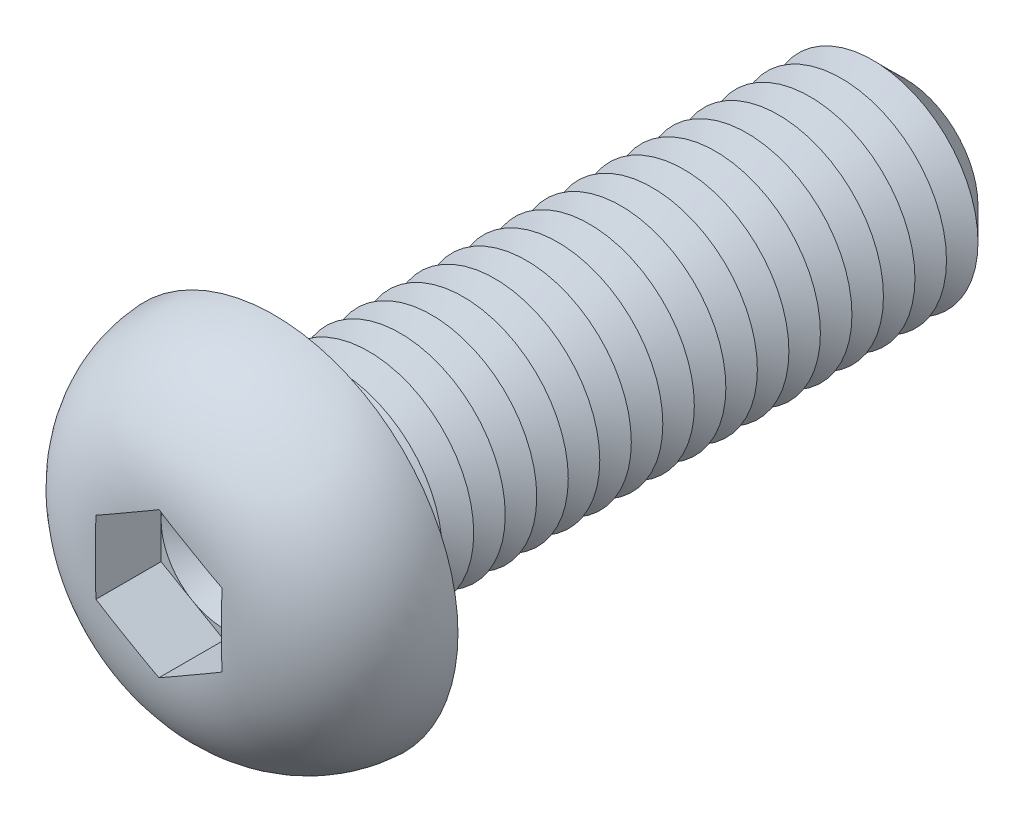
from build123d import *

# Parameters (mm, degrees)
CUT_EXTRUDE1_DEPTH  = 3.12
SKETCH4_R           = 5
BOSS_EXTRUDE1_DEPTH = 30
CHAMFER1_SIZE       = 1.5
LPATTERN1_COUNT     = 18
LPATTERN1_PITCH     = 1.5
FILLET2_R           = 0.6


with BuildPart() as part:
    # Sketch2 → Revolve1 (revolve)
    with BuildSketch(Plane(origin=(0, 0, 0), x_dir=(0, 0, -1), z_dir=(1, 0, 0)), mode=Mode.PRIVATE) as revolve1_sk:
        with BuildLine():
            Line((0, 0), (-5.5, 0))
            Line((-5.5, 0), (-5.5, 2.957763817))
            ThreePointArc((-5.5, 2.957763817), (-3.905948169, 6.951508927), (0, 8.75))
            Line((0, 8.75), (0, 0))
        make_face()
    revolve(revolve1_sk.sketch.rotate(Axis((0, 0, 47.934239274), (0, 0, -1)), 90), axis=Axis((0, 0, 47.934239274), (0, 0, -1)))

    # Sketch3 → Cut-Extrude1 (cut)
    with BuildSketch(Plane.XY.offset(5.5)):
        Polygon((0, 3.464101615), (-3, 1.732050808), (-3, -1.732050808), (0, -3.464101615), (3, -1.732050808), (3, 1.732050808), align=None)
    extrude(amount=-CUT_EXTRUDE1_DEPTH, mode=Mode.SUBTRACT)

    # Sketch4 → Boss-Extrude1 (add)
    with BuildSketch(Plane(origin=(0, 0, 0), x_dir=(-1, 0, 0), z_dir=(0, 0, -1))):
        with Locations(Location((0, 0, 0), (0, 0, 180))):
            Circle(SKETCH4_R)
    extrude(amount=BOSS_EXTRUDE1_DEPTH)

    # Chamfer1
    chamfer1_edges = [part.edges().sort_by_distance(p)[0] for p in [
        (-5, 0, -30),
    ]]
    chamfer(chamfer1_edges, length=CHAMFER1_SIZE)

    # Sketch5 → Cut-Revolve1 (revolve, cut)
    with BuildSketch(Plane(origin=(0, 0, 0), x_dir=(0, 0, -1), z_dir=(1, 0, 0)), mode=Mode.PRIVATE) as cut_revolve1_sk:
        Polygon((1.5, 5), (3, 5), (2.25, 3.700961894), align=None)
    cut_revolve1 = revolve(cut_revolve1_sk.sketch.rotate(Axis((0, 0, 47.934239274), (0, 0, -1)), 90), axis=Axis((0, 0, 47.934239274), (0, 0, -1)), mode=Mode.SUBTRACT)

    # LPattern1: Cut-Revolve1 ×18
    with Locations(*[(0, 0, -i * LPATTERN1_PITCH) for i in range(1, LPATTERN1_COUNT)]):
        add(cut_revolve1, mode=Mode.SUBTRACT)

    # Fillet2
    fillet2_edges = [part.edges().sort_by_distance(p)[0] for p in [
        (-5, 0, 0),
    ]]
    fillet(fillet2_edges, radius=FILLET2_R)

    # Cut-Extrude2 cone 1 section (on through the dimple's axis) → Cut-Extrude2 (revolve, cut)
    with BuildSketch(Plane(origin=(0, 0, 2.38), x_dir=(0, -1, 0), z_dir=(1, 0, 0))):
        Polygon((0, 0), (3, 0), (0, 1.732050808), align=None)
    revolve(axis=Axis((0, 0, 2.38), (0, 0, -1)), mode=Mode.SUBTRACT)


solid = part.part
